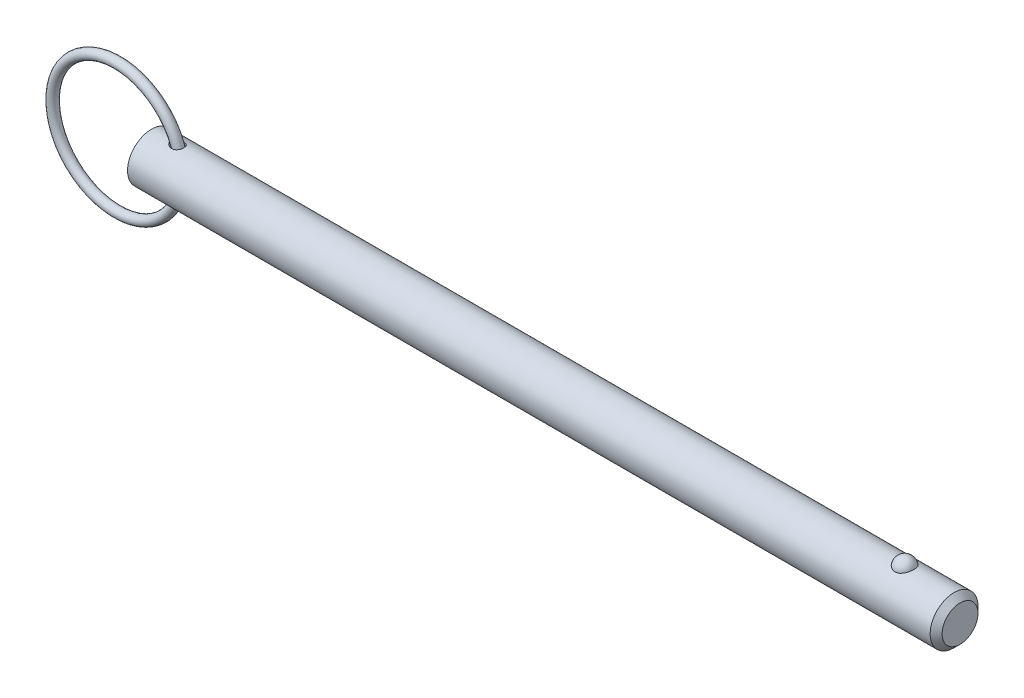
ISO-10303-21;
HEADER;
FILE_DESCRIPTION(('STEP AP214'),'2;1');
FILE_NAME('part.step','',(''),(''),'','','');
FILE_SCHEMA(('AUTOMOTIVE_DESIGN { 1 0 10303 214 1 1 1 1 }'));
ENDSEC;
DATA;
#1=APPLICATION_CONTEXT('core data for automotive mechanical design processes');
#2=APPLICATION_PROTOCOL_DEFINITION('international standard','automotive_design',2000,#1);
#3=PRODUCT_CONTEXT('',#1,'mechanical');
#4=PRODUCT('Part','Part','',(#3));
#5=PRODUCT_RELATED_PRODUCT_CATEGORY('part','',(#4));
#6=PRODUCT_DEFINITION_FORMATION('','',#4);
#7=PRODUCT_DEFINITION_CONTEXT('part definition',#1,'design');
#8=PRODUCT_DEFINITION('design','',#6,#7);
#9=PRODUCT_DEFINITION_SHAPE('','',#8);
#10=(LENGTH_UNIT() NAMED_UNIT(*) SI_UNIT(.MILLI.,.METRE.));
#11=(NAMED_UNIT(*) PLANE_ANGLE_UNIT() SI_UNIT($,.RADIAN.));
#12=(NAMED_UNIT(*) SI_UNIT($,.STERADIAN.) SOLID_ANGLE_UNIT());
#13=UNCERTAINTY_MEASURE_WITH_UNIT(LENGTH_MEASURE(1.E-05),#10,'distance_accuracy_value','');
#14=(GEOMETRIC_REPRESENTATION_CONTEXT(3) GLOBAL_UNCERTAINTY_ASSIGNED_CONTEXT((#13)) GLOBAL_UNIT_ASSIGNED_CONTEXT((#10,
#11,#12)) REPRESENTATION_CONTEXT('',''));
#15=CARTESIAN_POINT('',(0.,0.,0.));
#16=DIRECTION('',(0.,0.,1.));
#17=DIRECTION('',(1.,0.,0.));
#18=AXIS2_PLACEMENT_3D('',#15,#16,#17);
#19=CARTESIAN_POINT('',(-6.70471658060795,0.,0.));
#20=DIRECTION('',(0.,0.,1.));
#21=DIRECTION('',(1.,0.,0.));
#22=AXIS2_PLACEMENT_3D('',#19,#20,#21);
#23=TOROIDAL_SURFACE('',#22,12.7,0.940000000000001);
#24=CARTESIAN_POINT('',(6.93528341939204,0.,0.));
#25=VERTEX_POINT('',#24);
#26=VERTEX_LOOP('',#25);
#27=FACE_BOUND('',#26,.T.);
#28=ADVANCED_FACE('P0_F12',(#27),#23,.T.);
#29=CLOSED_SHELL('',(#28));
#30=MANIFOLD_SOLID_BREP('P0_B1',#29);
#31=CARTESIAN_POINT('',(0.,0.,0.));
#32=DIRECTION('',(1.,0.,0.));
#33=DIRECTION('',(0.,0.,-1.));
#34=AXIS2_PLACEMENT_3D('',#31,#32,#33);
#35=CYLINDRICAL_SURFACE('',#34,4.7);
#36=CARTESIAN_POINT('',(4.16378072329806,4.63584137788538,-0.773934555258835));
#37=CARTESIAN_POINT('',(4.22041228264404,4.62659903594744,-0.829297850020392));
#38=CARTESIAN_POINT('',(4.28206987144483,4.61719767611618,-0.87952289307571));
#39=CARTESIAN_POINT('',(4.41303152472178,4.59925351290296,-0.968997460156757));
#40=CARTESIAN_POINT('',(4.48234424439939,4.59071170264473,-1.00823437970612));
#41=CARTESIAN_POINT('',(4.62650734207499,4.5755493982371,-1.07495006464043));
#42=CARTESIAN_POINT('',(4.70135029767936,4.56892638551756,-1.10244426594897));
#43=CARTESIAN_POINT('',(4.85470490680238,4.55848940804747,-1.14483874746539));
#44=CARTESIAN_POINT('',(4.93321503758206,4.55467428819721,-1.15974420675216));
#45=CARTESIAN_POINT('',(5.09197970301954,4.55051176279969,-1.17597559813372));
#46=CARTESIAN_POINT('',(5.17223836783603,4.55017372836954,-1.17726483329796));
#47=CARTESIAN_POINT('',(5.33159446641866,4.55326696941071,-1.16524823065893));
#48=CARTESIAN_POINT('',(5.41069268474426,4.55669556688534,-1.15195276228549));
#49=CARTESIAN_POINT('',(5.55698758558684,4.56647801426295,-1.11249214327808));
#50=CARTESIAN_POINT('',(5.62458628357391,4.57250771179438,-1.08773548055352));
#51=CARTESIAN_POINT('',(5.7539770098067,4.58665356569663,-1.02644632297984));
#52=CARTESIAN_POINT('',(5.81577171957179,4.59476875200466,-0.989919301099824));
#53=CARTESIAN_POINT('',(5.92681484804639,4.61135052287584,-0.90939126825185));
#54=CARTESIAN_POINT('',(5.97666790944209,4.61973919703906,-0.866204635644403));
#55=CARTESIAN_POINT('',(6.06817854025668,4.63643253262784,-0.771868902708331));
#56=CARTESIAN_POINT('',(6.10983710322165,4.64473720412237,-0.720720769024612));
#57=CARTESIAN_POINT('',(6.18318089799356,4.660174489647,-0.612928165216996));
#58=CARTESIAN_POINT('',(6.21503150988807,4.66732544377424,-0.55639864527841));
#59=CARTESIAN_POINT('',(6.26900210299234,4.67985590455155,-0.438689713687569));
#60=CARTESIAN_POINT('',(6.29112194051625,4.68523538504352,-0.377510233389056));
#61=CARTESIAN_POINT('',(6.3252384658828,4.6936733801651,-0.251831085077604));
#62=CARTESIAN_POINT('',(6.33717189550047,4.69671737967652,-0.187313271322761));
#63=CARTESIAN_POINT('',(6.35042407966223,4.70010386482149,-0.0571258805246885));
#64=CARTESIAN_POINT('',(6.3517424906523,4.70044626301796,0.00854373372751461));
#65=CARTESIAN_POINT('',(6.34371729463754,4.69838816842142,0.139481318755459));
#66=CARTESIAN_POINT('',(6.33432596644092,4.69597539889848,0.204746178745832));
#67=CARTESIAN_POINT('',(6.30500866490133,4.68864655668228,0.332720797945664));
#68=CARTESIAN_POINT('',(6.28508259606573,4.68373046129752,0.395430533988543));
#69=CARTESIAN_POINT('',(6.23516511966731,4.67193431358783,0.516455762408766));
#70=CARTESIAN_POINT('',(6.20518126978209,4.66505573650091,0.574774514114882));
#71=CARTESIAN_POINT('',(6.1358631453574,4.65009270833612,0.685387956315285));
#72=CARTESIAN_POINT('',(6.09652950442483,4.64200833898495,0.737683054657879));
#73=CARTESIAN_POINT('',(6.00979078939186,4.62559001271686,0.834455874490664));
#74=CARTESIAN_POINT('',(5.96243625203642,4.61725787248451,0.878979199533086));
#75=CARTESIAN_POINT('',(5.86079843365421,4.60122574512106,0.959378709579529));
#76=CARTESIAN_POINT('',(5.80651591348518,4.59352568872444,0.995255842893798));
#77=CARTESIAN_POINT('',(5.69277386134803,4.57961669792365,1.05741527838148));
#78=CARTESIAN_POINT('',(5.63333134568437,4.57340309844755,1.08372773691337));
#79=CARTESIAN_POINT('',(5.5108424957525,4.56305640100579,1.12650026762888));
#80=CARTESIAN_POINT('',(5.44779577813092,4.55892352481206,1.14295928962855));
#81=CARTESIAN_POINT('',(5.3179566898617,4.55299444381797,1.1663590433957));
#82=CARTESIAN_POINT('',(5.25110869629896,4.55127026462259,1.17300670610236));
#83=CARTESIAN_POINT('',(5.11716812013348,4.55043953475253,1.17622268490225));
#84=CARTESIAN_POINT('',(5.05007546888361,4.55133378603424,1.17278791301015));
#85=CARTESIAN_POINT('',(4.91166083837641,4.55569951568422,1.15571913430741));
#86=CARTESIAN_POINT('',(4.84044690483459,4.55937764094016,1.1412666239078));
#87=CARTESIAN_POINT('',(4.70108819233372,4.56903562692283,1.10196123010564));
#88=CARTESIAN_POINT('',(4.63294574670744,4.57501720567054,1.07710058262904));
#89=CARTESIAN_POINT('',(4.4947730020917,4.58927184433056,1.01474439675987));
#90=CARTESIAN_POINT('',(4.42520748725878,4.59771156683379,0.976252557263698));
#91=CARTESIAN_POINT('',(4.29354165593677,4.61552030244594,0.888246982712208));
#92=CARTESIAN_POINT('',(4.23143936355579,4.62488906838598,0.838736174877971));
#93=CARTESIAN_POINT('',(4.12609666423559,4.64192969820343,0.738015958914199));
#94=CARTESIAN_POINT('',(4.08142630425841,4.64963595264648,0.68830869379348));
#95=CARTESIAN_POINT('',(4.0008117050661,4.66411457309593,0.582144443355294));
#96=CARTESIAN_POINT('',(3.96485623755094,4.6708881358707,0.525696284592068));
#97=CARTESIAN_POINT('',(3.90818393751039,4.68183565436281,0.415917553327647));
#98=CARTESIAN_POINT('',(3.88599581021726,4.68624644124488,0.363372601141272));
#99=CARTESIAN_POINT('',(3.85055971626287,4.693376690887,0.255230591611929));
#100=CARTESIAN_POINT('',(3.83730635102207,4.69609717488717,0.199635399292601));
#101=CARTESIAN_POINT('',(3.82058225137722,4.69954043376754,0.0867104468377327));
#102=CARTESIAN_POINT('',(3.81714632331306,4.70025610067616,0.0293752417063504));
#103=CARTESIAN_POINT('',(3.8204140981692,4.69957935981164,-0.0849928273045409));
#104=CARTESIAN_POINT('',(3.82711802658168,4.69818690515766,-0.14202568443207));
#105=CARTESIAN_POINT('',(3.84950128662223,4.69360426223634,-0.250744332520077));
#106=CARTESIAN_POINT('',(3.8646389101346,4.69052274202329,-0.302548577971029));
#107=CARTESIAN_POINT('',(3.90261190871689,4.68295207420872,-0.403121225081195));
#108=CARTESIAN_POINT('',(3.92544863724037,4.67846267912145,-0.451889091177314));
#109=CARTESIAN_POINT('',(3.97999306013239,4.6680441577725,-0.549522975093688));
#110=CARTESIAN_POINT('',(4.01228648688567,4.66202553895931,-0.598050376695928));
#111=CARTESIAN_POINT('',(4.08340845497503,4.64931397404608,-0.689954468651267));
#112=CARTESIAN_POINT('',(4.12224260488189,4.64262045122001,-0.733326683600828));
#113=CARTESIAN_POINT('',(4.16378072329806,4.63584137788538,-0.773934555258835));
#114=B_SPLINE_CURVE_WITH_KNOTS('',3,(#36,#37,#38,#39,#40,#41,#42,#43,#44,#45,#46,#47,#48,#49,
#50,#51,#52,#53,#54,#55,#56,#57,#58,#59,#60,#61,#62,#63,#64,#65,#66,#67,#68,#69,#70,#71,#72,#73,
#74,#75,#76,#77,#78,#79,#80,#81,#82,#83,#84,#85,#86,#87,#88,#89,#90,#91,#92,#93,#94,#95,#96,#97,
#98,#99,#100,#101,#102,#103,#104,#105,#106,#107,#108,#109,#110,#111,#112,#113),.UNSPECIFIED.,
.T.,.F.,(4,2,2,2,2,2,2,2,2,2,2,2,2,2,2,2,2,2,2,2,2,2,2,2,2,2,2,2,2,2,2,2,2,2,2,2,2,2,4),(0.,
0.238977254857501,0.478227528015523,0.717162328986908,0.955998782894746,1.19547875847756,
1.43478857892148,1.65034375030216,1.8657988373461,2.06429861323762,2.26277430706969,
2.45769248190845,2.65261353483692,2.848736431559,3.04486567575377,3.24187227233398,
3.43888065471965,3.6357413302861,3.83258866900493,4.02823898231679,4.22386782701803,
4.41887441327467,4.61390177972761,4.81464443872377,5.0154485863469,5.2328283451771,
5.45037055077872,5.68914354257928,5.92785317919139,6.12887730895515,6.32964104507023,
6.50053592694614,6.67132745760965,6.84272375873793,7.0141238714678,7.17560768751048,
7.33711990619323,7.5122540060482,7.68753905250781),.UNSPECIFIED.);
#115=CARTESIAN_POINT('',(4.16378072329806,4.63584137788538,-0.773934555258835));
#116=VERTEX_POINT('',#115);
#117=EDGE_CURVE('P1_E40',#116,#116,#114,.T.);
#118=ORIENTED_EDGE('',*,*,#117,.T.);
#119=EDGE_LOOP('',(#118));
#120=FACE_BOUND('',#119,.T.);
#121=CARTESIAN_POINT('',(157.575,0.,0.));
#122=DIRECTION('',(1.,0.,0.));
#123=DIRECTION('',(0.,0.,-1.));
#124=AXIS2_PLACEMENT_3D('',#121,#122,#123);
#125=CIRCLE('',#124,4.7);
#126=CARTESIAN_POINT('',(157.575,0.,-4.7));
#127=VERTEX_POINT('',#126);
#128=EDGE_CURVE('P1_E25',#127,#127,#125,.T.);
#129=ORIENTED_EDGE('',*,*,#128,.F.);
#130=EDGE_LOOP('',(#129));
#131=FACE_BOUND('',#130,.T.);
#132=CARTESIAN_POINT('',(0.,0.,0.));
#133=DIRECTION('',(1.,0.,0.));
#134=DIRECTION('',(0.,0.,-1.));
#135=AXIS2_PLACEMENT_3D('',#132,#133,#134);
#136=CIRCLE('',#135,4.7);
#137=CARTESIAN_POINT('',(0.,0.,-4.7));
#138=VERTEX_POINT('',#137);
#139=EDGE_CURVE('P1_E9',#138,#138,#136,.T.);
#140=ORIENTED_EDGE('',*,*,#139,.T.);
#141=EDGE_LOOP('',(#140));
#142=FACE_BOUND('',#141,.T.);
#143=CARTESIAN_POINT('',(147.88062830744,4.30387706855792,1.88855557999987));
#144=CARTESIAN_POINT('',(147.782813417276,4.30388592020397,1.88854684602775));
#145=CARTESIAN_POINT('',(147.684851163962,4.30731231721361,1.88078712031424));
#146=CARTESIAN_POINT('',(147.491662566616,4.32065009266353,1.84993192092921));
#147=CARTESIAN_POINT('',(147.396443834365,4.33057798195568,1.82679740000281));
#148=CARTESIAN_POINT('',(147.21181755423,4.3557457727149,1.76594245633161));
#149=CARTESIAN_POINT('',(147.122395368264,4.37097162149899,1.72826059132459));
#150=CARTESIAN_POINT('',(146.951390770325,4.4050778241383,1.6393730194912));
#151=CARTESIAN_POINT('',(146.869805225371,4.42395670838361,1.58817274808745));
#152=CARTESIAN_POINT('',(146.713901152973,4.46404088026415,1.47181116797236));
#153=CARTESIAN_POINT('',(146.639875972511,4.48529915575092,1.40627540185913));
#154=CARTESIAN_POINT('',(146.503536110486,4.527485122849,1.26387806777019));
#155=CARTESIAN_POINT('',(146.441224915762,4.54841271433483,1.18701313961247));
#156=CARTESIAN_POINT('',(146.327072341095,4.58876216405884,1.02025841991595));
#157=CARTESIAN_POINT('',(146.275811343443,4.60807744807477,0.929944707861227));
#158=CARTESIAN_POINT('',(146.18842456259,4.6421320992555,0.741468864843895));
#159=CARTESIAN_POINT('',(146.152299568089,4.65687122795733,0.643306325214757));
#160=CARTESIAN_POINT('',(146.095671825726,4.68038485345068,0.440967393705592));
#161=CARTESIAN_POINT('',(146.075304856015,4.68910744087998,0.336746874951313));
#162=CARTESIAN_POINT('',(146.051132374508,4.69949255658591,0.126059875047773));
#163=CARTESIAN_POINT('',(146.047326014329,4.70115544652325,0.0195935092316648));
#164=CARTESIAN_POINT('',(146.056308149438,4.69727256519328,-0.191500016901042));
#165=CARTESIAN_POINT('',(146.068941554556,4.69179416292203,-0.296135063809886));
#166=CARTESIAN_POINT('',(146.110276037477,4.67429351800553,-0.501612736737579));
#167=CARTESIAN_POINT('',(146.138977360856,4.66227117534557,-0.602455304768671));
#168=CARTESIAN_POINT('',(146.211928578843,4.63286427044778,-0.797707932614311));
#169=CARTESIAN_POINT('',(146.256204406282,4.61547077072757,-0.892106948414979));
#170=CARTESIAN_POINT('',(146.359407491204,4.5770990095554,-1.07173134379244));
#171=CARTESIAN_POINT('',(146.418336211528,4.55612039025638,-1.15695580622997));
#172=CARTESIAN_POINT('',(146.550216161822,4.51257918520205,-1.31664252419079));
#173=CARTESIAN_POINT('',(146.623286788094,4.49000423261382,-1.39100294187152));
#174=CARTESIAN_POINT('',(146.781478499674,4.44594443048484,-1.52598548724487));
#175=CARTESIAN_POINT('',(146.866599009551,4.42445952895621,-1.58660827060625));
#176=CARTESIAN_POINT('',(147.045267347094,4.38543655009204,-1.69145998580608));
#177=CARTESIAN_POINT('',(147.138651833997,4.36783887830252,-1.73594433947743));
#178=CARTESIAN_POINT('',(147.33242205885,4.3382941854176,-1.80852276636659));
#179=CARTESIAN_POINT('',(147.432805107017,4.32634500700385,-1.83662309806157));
#180=CARTESIAN_POINT('',(147.63228752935,4.31005085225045,-1.87453136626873));
#181=CARTESIAN_POINT('',(147.731196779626,4.30535309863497,-1.88518956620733));
#182=CARTESIAN_POINT('',(147.929521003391,4.30299844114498,-1.89055986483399));
#183=CARTESIAN_POINT('',(148.028935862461,4.30534000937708,-1.88527542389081));
#184=CARTESIAN_POINT('',(148.22186386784,4.31657737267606,-1.85939299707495));
#185=CARTESIAN_POINT('',(148.315462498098,4.32524571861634,-1.83932621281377));
#186=CARTESIAN_POINT('',(148.497783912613,4.34791518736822,-1.78507441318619));
#187=CARTESIAN_POINT('',(148.586506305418,4.36191673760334,-1.7508882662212));
#188=CARTESIAN_POINT('',(148.758694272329,4.39411605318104,-1.66845234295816));
#189=CARTESIAN_POINT('',(148.842008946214,4.41239631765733,-1.61992036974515));
#190=CARTESIAN_POINT('',(148.999399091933,4.45109244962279,-1.51034589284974));
#191=CARTESIAN_POINT('',(149.073472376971,4.47150882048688,-1.44930043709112));
#192=CARTESIAN_POINT('',(149.214405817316,4.51353865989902,-1.31275193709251));
#193=CARTESIAN_POINT('',(149.280701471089,4.53515983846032,-1.23666813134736));
#194=CARTESIAN_POINT('',(149.400069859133,4.57635116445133,-1.07425533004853));
#195=CARTESIAN_POINT('',(149.45314024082,4.5959209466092,-0.987924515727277));
#196=CARTESIAN_POINT('',(149.546443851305,4.63161819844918,-0.804428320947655));
#197=CARTESIAN_POINT('',(149.586229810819,4.64762063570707,-0.707010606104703));
#198=CARTESIAN_POINT('',(149.649825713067,4.67374032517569,-0.506344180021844));
#199=CARTESIAN_POINT('',(149.673635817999,4.68385763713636,-0.403095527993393));
#200=CARTESIAN_POINT('',(149.704751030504,4.69716075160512,-0.19397572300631));
#201=CARTESIAN_POINT('',(149.712098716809,4.70036443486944,-0.0881120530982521));
#202=CARTESIAN_POINT('',(149.710261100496,4.6995691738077,0.12344125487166));
#203=CARTESIAN_POINT('',(149.701076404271,4.69557049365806,0.229130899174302));
#204=CARTESIAN_POINT('',(149.666492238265,4.68082941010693,0.436545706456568));
#205=CARTESIAN_POINT('',(149.641209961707,4.67013575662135,0.538293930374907));
#206=CARTESIAN_POINT('',(149.575050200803,4.64311776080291,0.735797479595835));
#207=CARTESIAN_POINT('',(149.534171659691,4.62679303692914,0.831552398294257));
#208=CARTESIAN_POINT('',(149.437286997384,4.5900271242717,1.01512750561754));
#209=CARTESIAN_POINT('',(149.381173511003,4.56955699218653,1.10288523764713));
#210=CARTESIAN_POINT('',(149.25510852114,4.52671789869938,1.26730106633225));
#211=CARTESIAN_POINT('',(149.185157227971,4.50434896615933,1.3439593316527));
#212=CARTESIAN_POINT('',(149.032724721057,4.46008413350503,1.48428028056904));
#213=CARTESIAN_POINT('',(148.950209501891,4.43818970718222,1.54790656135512));
#214=CARTESIAN_POINT('',(148.774735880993,4.39746476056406,1.66008504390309));
#215=CARTESIAN_POINT('',(148.681773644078,4.37863537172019,1.70863168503));
#216=CARTESIAN_POINT('',(148.491099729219,4.34688784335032,1.78783023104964));
#217=CARTESIAN_POINT('',(148.393629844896,4.33380220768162,1.81899757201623));
#218=CARTESIAN_POINT('',(148.194405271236,4.31435159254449,1.86467392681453));
#219=CARTESIAN_POINT('',(148.092663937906,4.30796708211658,1.87923136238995));
#220=CARTESIAN_POINT('',(147.95391360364,4.3043503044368,1.8874737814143));
#221=CARTESIAN_POINT('',(147.91728130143,4.30387375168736,1.8885588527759));
#222=CARTESIAN_POINT('',(147.88062830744,4.30387706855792,1.88855557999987));
#223=B_SPLINE_CURVE_WITH_KNOTS('',3,(#143,#144,#145,#146,#147,#148,#149,#150,#151,#152,#153,
#154,#155,#156,#157,#158,#159,#160,#161,#162,#163,#164,#165,#166,#167,#168,#169,#170,#171,#172,
#173,#174,#175,#176,#177,#178,#179,#180,#181,#182,#183,#184,#185,#186,#187,#188,#189,#190,#191,
#192,#193,#194,#195,#196,#197,#198,#199,#200,#201,#202,#203,#204,#205,#206,#207,#208,#209,#210,
#211,#212,#213,#214,#215,#216,#217,#218,#219,#220,#221,#222),.UNSPECIFIED.,.T.,.F.,(4,2,2,2,2,2,
2,2,2,2,2,2,2,2,2,2,2,2,2,2,2,2,2,2,2,2,2,2,2,2,2,2,2,2,2,2,2,2,2,4),(0.,0.293339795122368,
0.587427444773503,0.880740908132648,1.17393661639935,1.47597417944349,1.77810150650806,
2.09350493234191,2.40892479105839,2.72703308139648,3.04512507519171,3.36023788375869,
3.67535550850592,3.9910003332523,4.30667668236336,4.62514463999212,4.94359739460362,
5.25676407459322,5.56981105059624,5.86708641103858,6.16429725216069,6.45131888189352,
6.73836351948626,7.03148013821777,7.3246659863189,7.63288296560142,7.94115473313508,
8.25895074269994,8.57674352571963,8.89371340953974,9.21067166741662,9.52534839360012,
9.84004644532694,10.1570225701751,10.4739938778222,10.7918388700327,11.1098009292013,
11.4177488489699,11.7247967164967,11.834716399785),.UNSPECIFIED.);
#224=CARTESIAN_POINT('',(147.88062830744,4.30387706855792,1.88855557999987));
#225=VERTEX_POINT('',#224);
#226=EDGE_CURVE('P1_E34',#225,#225,#223,.T.);
#227=ORIENTED_EDGE('',*,*,#226,.T.);
#228=EDGE_LOOP('',(#227));
#229=FACE_BOUND('',#228,.T.);
#230=CARTESIAN_POINT('',(4.16378072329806,-4.63584137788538,-0.773934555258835));
#231=CARTESIAN_POINT('',(4.11797605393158,-4.64331682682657,-0.729154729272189));
#232=CARTESIAN_POINT('',(4.07545237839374,-4.65068929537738,-0.681007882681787));
#233=CARTESIAN_POINT('',(3.99850919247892,-4.66454993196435,-0.578483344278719));
#234=CARTESIAN_POINT('',(3.96408464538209,-4.67103864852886,-0.524109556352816));
#235=CARTESIAN_POINT('',(3.90486465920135,-4.68247538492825,-0.409579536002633));
#236=CARTESIAN_POINT('',(3.88014787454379,-4.68741075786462,-0.349380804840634));
#237=CARTESIAN_POINT('',(3.84254060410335,-4.69500854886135,-0.225256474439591));
#238=CARTESIAN_POINT('',(3.82963753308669,-4.69767338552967,-0.161334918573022));
#239=CARTESIAN_POINT('',(3.81750619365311,-4.70018000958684,-0.0396774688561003));
#240=CARTESIAN_POINT('',(3.8168623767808,-4.70031401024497,0.0179134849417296));
#241=CARTESIAN_POINT('',(3.82570055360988,-4.69848615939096,0.132270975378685));
#242=CARTESIAN_POINT('',(3.83518142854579,-4.6965245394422,0.189037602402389));
#243=CARTESIAN_POINT('',(3.8627670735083,-4.69091189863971,0.296808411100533));
#244=CARTESIAN_POINT('',(3.88034293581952,-4.68736483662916,0.347956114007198));
#245=CARTESIAN_POINT('',(3.92293217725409,-4.67896699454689,0.446919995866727));
#246=CARTESIAN_POINT('',(3.94794743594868,-4.67411588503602,0.494735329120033));
#247=CARTESIAN_POINT('',(4.00723361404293,-4.66297432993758,0.590975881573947));
#248=CARTESIAN_POINT('',(4.04218787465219,-4.65658759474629,0.63896688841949));
#249=CARTESIAN_POINT('',(4.11850165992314,-4.64327412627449,0.729452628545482));
#250=CARTESIAN_POINT('',(4.15986486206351,-4.63634708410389,0.771944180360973));
#251=CARTESIAN_POINT('',(4.25563139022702,-4.62124878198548,0.858077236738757));
#252=CARTESIAN_POINT('',(4.3110472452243,-4.61307408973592,0.900593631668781));
#253=CARTESIAN_POINT('',(4.42760239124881,-4.59748077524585,0.977085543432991));
#254=CARTESIAN_POINT('',(4.48874590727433,-4.59006271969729,1.01105468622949));
#255=CARTESIAN_POINT('',(4.62409915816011,-4.5757760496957,1.07399161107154));
#256=CARTESIAN_POINT('',(4.69895162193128,-4.56912175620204,1.10163764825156));
#257=CARTESIAN_POINT('',(4.85238616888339,-4.55861611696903,1.14433682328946));
#258=CARTESIAN_POINT('',(4.93096882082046,-4.55476520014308,1.15938803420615));
#259=CARTESIAN_POINT('',(5.08983848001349,-4.55053674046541,1.17587995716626));
#260=CARTESIAN_POINT('',(5.17012835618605,-4.55016559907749,1.17729558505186));
#261=CARTESIAN_POINT('',(5.32956049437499,-4.55319561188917,1.16552635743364));
#262=CARTESIAN_POINT('',(5.40870366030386,-4.55659361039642,1.15235371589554));
#263=CARTESIAN_POINT('',(5.55512154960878,-4.56632591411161,1.11311448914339));
#264=CARTESIAN_POINT('',(5.62279525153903,-4.57233592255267,1.08845479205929));
#265=CARTESIAN_POINT('',(5.75235194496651,-4.58645252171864,1.02734156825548));
#266=CARTESIAN_POINT('',(5.81423750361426,-4.59455817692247,0.990893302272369));
#267=CARTESIAN_POINT('',(5.92544729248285,-4.61112960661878,0.910507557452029));
#268=CARTESIAN_POINT('',(5.9753775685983,-4.61951638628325,0.867388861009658));
#269=CARTESIAN_POINT('',(6.06705041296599,-4.63621447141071,0.773173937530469));
#270=CARTESIAN_POINT('',(6.10879399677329,-4.64452578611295,0.722078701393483));
#271=CARTESIAN_POINT('',(6.18230323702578,-4.65998194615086,0.614385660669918));
#272=CARTESIAN_POINT('',(6.21423602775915,-4.66714520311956,0.557904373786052));
#273=CARTESIAN_POINT('',(6.26837651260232,-4.67970630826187,0.440277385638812));
#274=CARTESIAN_POINT('',(6.29058407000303,-4.68510413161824,0.379131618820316));
#275=CARTESIAN_POINT('',(6.32487950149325,-4.69358284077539,0.253506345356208));
#276=CARTESIAN_POINT('',(6.33690441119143,-4.69664929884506,0.189008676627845));
#277=CARTESIAN_POINT('',(6.35034148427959,-4.70008248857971,0.05884554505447));
#278=CARTESIAN_POINT('',(6.35175330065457,-4.70044913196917,-0.00681995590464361));
#279=CARTESIAN_POINT('',(6.34391515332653,-4.69843881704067,-0.137767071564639));
#280=CARTESIAN_POINT('',(6.33461722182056,-4.69604951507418,-0.203045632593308));
#281=CARTESIAN_POINT('',(6.30548404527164,-4.68876413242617,-0.331063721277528));
#282=CARTESIAN_POINT('',(6.28564870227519,-4.68386802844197,-0.393803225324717));
#283=CARTESIAN_POINT('',(6.23590713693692,-4.67210599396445,-0.514904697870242));
#284=CARTESIAN_POINT('',(6.20600824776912,-4.66524149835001,-0.573269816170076));
#285=CARTESIAN_POINT('',(6.13685224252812,-4.65029918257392,-0.683989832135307));
#286=CARTESIAN_POINT('',(6.09759575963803,-4.6422214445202,-0.736345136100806));
#287=CARTESIAN_POINT('',(6.01099960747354,-4.62580793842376,-0.833250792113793));
#288=CARTESIAN_POINT('',(5.963710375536,-4.61747403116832,-0.877846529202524));
#289=CARTESIAN_POINT('',(5.8621900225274,-4.60143050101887,-0.958399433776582));
#290=CARTESIAN_POINT('',(5.80795966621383,-4.59372080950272,-0.99435755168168));
#291=CARTESIAN_POINT('',(5.69431062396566,-4.57978661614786,-1.05668157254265));
#292=CARTESIAN_POINT('',(5.63490936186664,-4.57355737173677,-1.08307825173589));
#293=CARTESIAN_POINT('',(5.51248756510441,-4.56317492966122,-1.12602176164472));
#294=CARTESIAN_POINT('',(5.44946662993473,-4.55902196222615,-1.1425675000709));
#295=CARTESIAN_POINT('',(5.31967752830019,-4.55305083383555,-1.16613984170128));
#296=CARTESIAN_POINT('',(5.25285368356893,-4.55130415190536,-1.17287534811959));
#297=CARTESIAN_POINT('',(5.11894995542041,-4.55042807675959,-1.17626714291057));
#298=CARTESIAN_POINT('',(5.05187000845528,-4.55129938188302,-1.17292074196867));
#299=CARTESIAN_POINT('',(4.91348721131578,-4.55561850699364,-1.15603764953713));
#300=CARTESIAN_POINT('',(4.84229084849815,-4.55927235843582,-1.14168541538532));
#301=CARTESIAN_POINT('',(4.70293860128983,-4.56888540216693,-1.10258192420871));
#302=CARTESIAN_POINT('',(4.63478566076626,-4.57484677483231,-1.07782082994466));
#303=CARTESIAN_POINT('',(4.49401200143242,-4.58932889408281,-1.01452290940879));
#304=CARTESIAN_POINT('',(4.42204931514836,-4.59808779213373,-0.974568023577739));
#305=CARTESIAN_POINT('',(4.28620227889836,-4.61656806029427,-0.882881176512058));
#306=CARTESIAN_POINT('',(4.22231268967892,-4.62628879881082,-0.831156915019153));
#307=CARTESIAN_POINT('',(4.16378072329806,-4.63584137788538,-0.773934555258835));
#308=B_SPLINE_CURVE_WITH_KNOTS('',3,(#230,#231,#232,#233,#234,#235,#236,#237,#238,#239,#240,
#241,#242,#243,#244,#245,#246,#247,#248,#249,#250,#251,#252,#253,#254,#255,#256,#257,#258,#259,
#260,#261,#262,#263,#264,#265,#266,#267,#268,#269,#270,#271,#272,#273,#274,#275,#276,#277,#278,
#279,#280,#281,#282,#283,#284,#285,#286,#287,#288,#289,#290,#291,#292,#293,#294,#295,#296,#297,
#298,#299,#300,#301,#302,#303,#304,#305,#306,#307),.UNSPECIFIED.,.T.,.F.,(4,2,2,2,2,2,2,2,2,2,2,
2,2,2,2,2,2,2,2,2,2,2,2,2,2,2,2,2,2,2,2,2,2,2,2,2,2,2,4),(0.,0.193263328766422,
0.386406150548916,0.581083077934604,0.775552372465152,0.947410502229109,1.11924964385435,
1.28117818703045,1.44314767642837,1.62161944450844,1.80019400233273,2.01034324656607,
2.22064874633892,2.45975127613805,2.69889038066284,2.93846932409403,3.1778478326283,
3.39350806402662,3.6090721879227,3.8076122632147,4.00612769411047,4.20104508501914,
4.39596521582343,4.59208201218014,4.78820522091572,4.98521027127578,5.18221715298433,
5.37908078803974,5.57593110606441,5.7715882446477,5.96722384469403,6.1622240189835,
6.35724581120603,6.55794420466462,6.75869613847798,6.97596054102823,7.1934307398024,
7.44055547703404,7.68751900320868),.UNSPECIFIED.);
#309=CARTESIAN_POINT('',(4.16378072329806,-4.63584137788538,-0.773934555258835));
#310=VERTEX_POINT('',#309);
#311=EDGE_CURVE('P1_E17',#310,#310,#308,.T.);
#312=ORIENTED_EDGE('',*,*,#311,.T.);
#313=EDGE_LOOP('',(#312));
#314=FACE_BOUND('',#313,.T.);
#315=ADVANCED_FACE('P1_F13',(#120,#131,#142,#229,#314),#35,.T.);
#316=CARTESIAN_POINT('',(0.,0.,0.));
#317=DIRECTION('',(-1.,0.,0.));
#318=DIRECTION('',(0.,0.,1.));
#319=AXIS2_PLACEMENT_3D('',#316,#317,#318);
#320=PLANE('',#319);
#321=ORIENTED_EDGE('',*,*,#139,.F.);
#322=EDGE_LOOP('',(#321));
#323=FACE_BOUND('',#322,.T.);
#324=ADVANCED_FACE('P1_F15',(#323),#320,.T.);
#325=CARTESIAN_POINT('',(158.75,0.,0.));
#326=DIRECTION('',(-1.,0.,0.));
#327=DIRECTION('',(0.,0.,1.));
#328=AXIS2_PLACEMENT_3D('',#325,#326,#327);
#329=CONICAL_SURFACE('',#328,3.52500000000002,0.785398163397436);
#330=ORIENTED_EDGE('',*,*,#128,.T.);
#331=EDGE_LOOP('',(#330));
#332=FACE_BOUND('',#331,.T.);
#333=CARTESIAN_POINT('',(158.75,0.,0.));
#334=DIRECTION('',(1.,0.,0.));
#335=DIRECTION('',(0.,0.,-1.));
#336=AXIS2_PLACEMENT_3D('',#333,#334,#335);
#337=CIRCLE('',#336,3.52500000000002);
#338=CARTESIAN_POINT('',(158.75,0.,-3.52500000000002));
#339=VERTEX_POINT('',#338);
#340=EDGE_CURVE('P1_E30',#339,#339,#337,.T.);
#341=ORIENTED_EDGE('',*,*,#340,.F.);
#342=EDGE_LOOP('',(#341));
#343=FACE_BOUND('',#342,.T.);
#344=ADVANCED_FACE('P1_F55',(#332,#343),#329,.T.);
#345=CARTESIAN_POINT('',(158.75,3.52500000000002,0.));
#346=DIRECTION('',(1.,0.,0.));
#347=DIRECTION('',(0.,0.,-1.));
#348=AXIS2_PLACEMENT_3D('',#345,#346,#347);
#349=PLANE('',#348);
#350=ORIENTED_EDGE('',*,*,#340,.T.);
#351=EDGE_LOOP('',(#350));
#352=FACE_BOUND('',#351,.T.);
#353=ADVANCED_FACE('P1_F51',(#352),#349,.T.);
#354=CARTESIAN_POINT('',(147.88062830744,4.23,0.));
#355=DIRECTION('',(-1.,0.,0.));
#356=DIRECTION('',(0.,1.,0.));
#357=AXIS2_PLACEMENT_3D('',#354,#355,#356);
#358=SPHERICAL_SURFACE('',#357,1.89);
#359=ORIENTED_EDGE('',*,*,#226,.F.);
#360=EDGE_LOOP('',(#359));
#361=FACE_BOUND('',#360,.T.);
#362=ADVANCED_FACE('P1_F46',(#361),#358,.T.);
#363=CARTESIAN_POINT('',(-6.70471658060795,0.,0.));
#364=DIRECTION('',(0.,0.,1.));
#365=DIRECTION('',(1.,0.,0.));
#366=AXIS2_PLACEMENT_3D('',#363,#364,#365);
#367=TOROIDAL_SURFACE('',#366,12.7,1.175);
#368=ORIENTED_EDGE('',*,*,#311,.F.);
#369=EDGE_LOOP('',(#368));
#370=FACE_BOUND('',#369,.T.);
#371=ORIENTED_EDGE('',*,*,#117,.F.);
#372=EDGE_LOOP('',(#371));
#373=FACE_BOUND('',#372,.T.);
#374=ADVANCED_FACE('P1_F50',(#370,#373),#367,.F.);
#375=CLOSED_SHELL('',(#315,#324,#344,#353,#362,#374));
#376=MANIFOLD_SOLID_BREP('P1_B1',#375);
#377=ADVANCED_BREP_SHAPE_REPRESENTATION('',(#18,#30,#376),#14);
#378=SHAPE_DEFINITION_REPRESENTATION(#9,#377);
ENDSEC;
END-ISO-10303-21;
